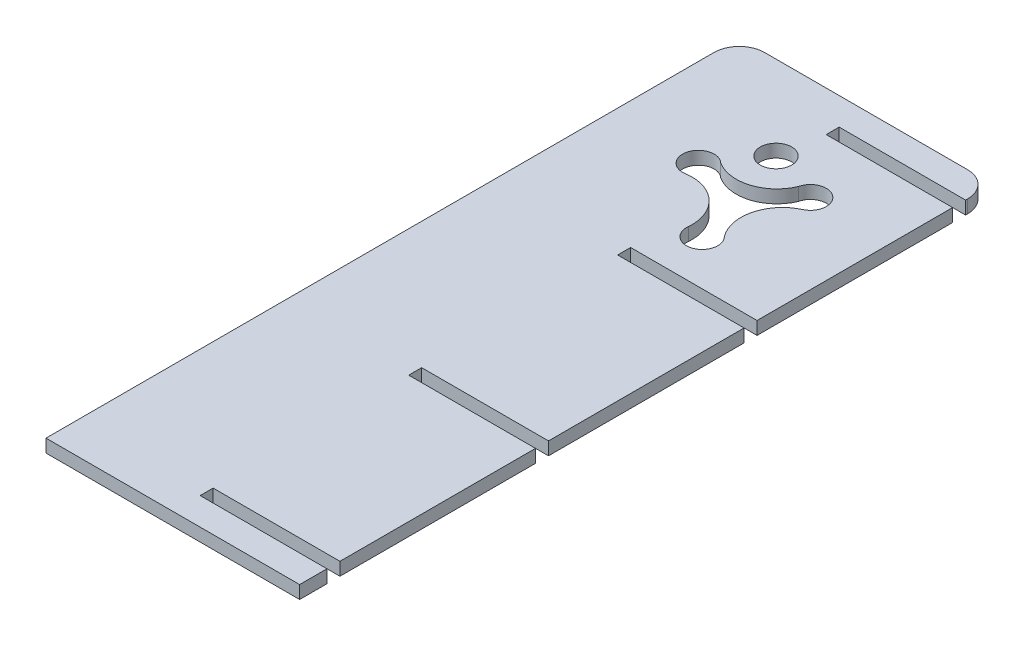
from build123d import *

# Parameters (mm, degrees)
CROQUIS1_R              = 27.861622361
SALIENTE_EXTRUIR1_DEPTH = 23


with BuildPart() as part:
    # Croquis1 → Saliente-Extruir1 (new body)
    with BuildSketch(Plane(origin=(0, 0, 0), x_dir=(1, 0, 0), z_dir=(0, 1, 0))):
        with BuildLine():
            Line((-56.986045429, 754.229373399), (-56.986045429, -430.770626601))
            Line((-56.986045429, -430.770626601), (393.013954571, -430.770626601))
            Line((393.013954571, -430.770626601), (393.013954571, -382.270626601))
            Line((393.013954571, -382.270626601), (168.013954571, -382.270626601))
            Line((168.013954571, -382.270626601), (168.013954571, -359.270626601))
            Line((168.013954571, -359.270626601), (393.013954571, -359.270626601))
            Line((393.013954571, -359.270626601), (393.013954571, -12.270626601))
            Line((393.013954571, -12.270626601), (168.013954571, -12.270626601))
            Line((168.013954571, -12.270626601), (168.013954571, 10.729373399))
            Line((168.013954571, 10.729373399), (393.013954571, 10.729373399))
            Line((393.013954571, 10.729373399), (393.013954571, 357.729373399))
            Line((393.013954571, 357.729373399), (168.716438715, 357.729373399))
            Line((168.716438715, 357.729373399), (168.716438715, 380.729373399))
            Line((168.716438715, 380.729373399), (393.013954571, 380.729373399))
            Line((393.013954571, 380.729373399), (393.013954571, 727.729373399))
            Line((393.013954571, 727.729373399), (168.716438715, 727.729373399))
            Line((168.716438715, 727.729373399), (168.716438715, 750.729373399))
            Line((168.716438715, 750.729373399), (393.013954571, 750.729373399))
            Line((393.013954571, 750.729373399), (393.013954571, 754.229373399))
            ThreePointArc((393.013954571, 754.229373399), (379.833759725, 786.049178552), (348.013954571, 799.229373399))
            Line((348.013954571, 799.229373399), (-11.986045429, 799.229373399))
            ThreePointArc((-11.986045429, 799.229373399), (-43.805850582, 786.049178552), (-56.986045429, 754.229373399))
        make_face()
        with Locations(Location((157.093759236, 650.277905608, 0), (0, 0, 270))):
            Circle(CROQUIS1_R, mode=Mode.SUBTRACT)
        with BuildLine():
            ThreePointArc((102.92971033, 542.619947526), (72.721991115, 579.184962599), (118.756659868, 590.600561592))
            ThreePointArc((118.756659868, 590.600561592), (178.878859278, 582.511354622), (223.84299475, 623.234083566))
            ThreePointArc((223.84299475, 623.234083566), (268.853905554, 639.104636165), (263.141677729, 591.720809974))
            ThreePointArc((263.141677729, 591.720809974), (263.064677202, 591.685081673), (262.987569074, 591.649586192))
            ThreePointArc((262.987569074, 591.649586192), (222.56374012, 542.882949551), (234.964527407, 480.766194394))
            ThreePointArc((234.964527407, 480.766194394), (225.468359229, 434.788490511), (187.7470056, 462.738909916))
            ThreePointArc((187.7470056, 462.738909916), (187.800978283, 463.401738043), (187.870759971, 464.063088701))
            ThreePointArc((187.870759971, 464.063088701), (165.076324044, 523.619412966), (104.268109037, 542.826262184))
            ThreePointArc((104.268109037, 542.826262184), (103.60015628, 542.715017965), (102.92971033, 542.619947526))
        make_face(mode=Mode.SUBTRACT)
    extrude(amount=SALIENTE_EXTRUIR1_DEPTH)


solid = part.part
